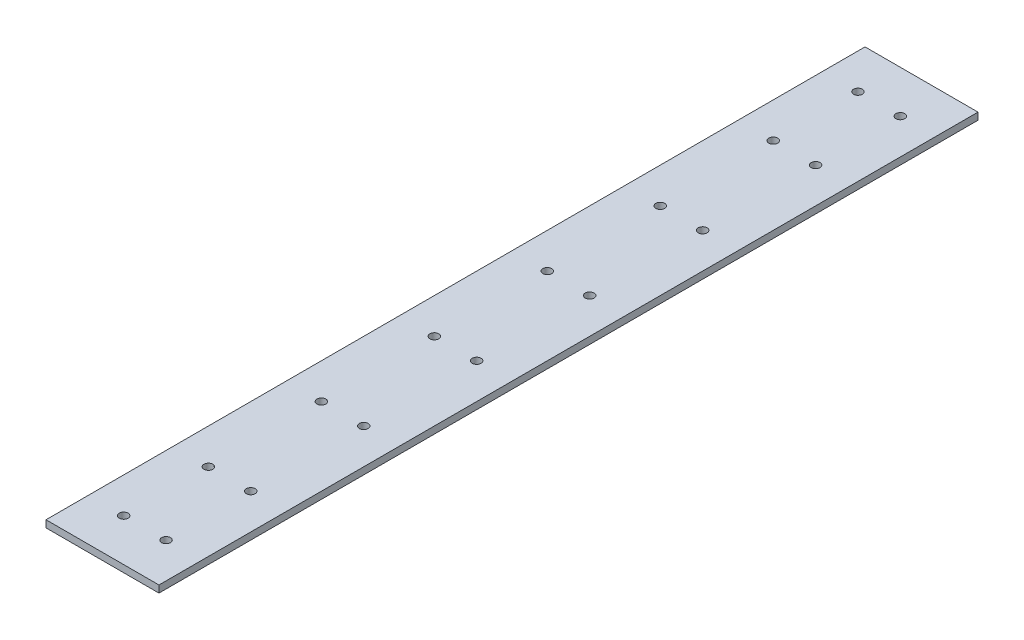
ISO-10303-21;
HEADER;
FILE_DESCRIPTION(('STEP AP214'),'2;1');
FILE_NAME('part.step','',(''),(''),'','','');
FILE_SCHEMA(('AUTOMOTIVE_DESIGN { 1 0 10303 214 1 1 1 1 }'));
ENDSEC;
DATA;
#1=APPLICATION_CONTEXT('core data for automotive mechanical design processes');
#2=APPLICATION_PROTOCOL_DEFINITION('international standard','automotive_design',2000,#1);
#3=PRODUCT_CONTEXT('',#1,'mechanical');
#4=PRODUCT('Part','Part','',(#3));
#5=PRODUCT_RELATED_PRODUCT_CATEGORY('part','',(#4));
#6=PRODUCT_DEFINITION_FORMATION('','',#4);
#7=PRODUCT_DEFINITION_CONTEXT('part definition',#1,'design');
#8=PRODUCT_DEFINITION('design','',#6,#7);
#9=PRODUCT_DEFINITION_SHAPE('','',#8);
#10=(LENGTH_UNIT() NAMED_UNIT(*) SI_UNIT(.MILLI.,.METRE.));
#11=(NAMED_UNIT(*) PLANE_ANGLE_UNIT() SI_UNIT($,.RADIAN.));
#12=(NAMED_UNIT(*) SI_UNIT($,.STERADIAN.) SOLID_ANGLE_UNIT());
#13=UNCERTAINTY_MEASURE_WITH_UNIT(LENGTH_MEASURE(1.E-05),#10,'distance_accuracy_value','');
#14=(GEOMETRIC_REPRESENTATION_CONTEXT(3) GLOBAL_UNCERTAINTY_ASSIGNED_CONTEXT((#13)) GLOBAL_UNIT_ASSIGNED_CONTEXT((#10,
#11,#12)) REPRESENTATION_CONTEXT('',''));
#15=CARTESIAN_POINT('',(0.,0.,0.));
#16=DIRECTION('',(0.,0.,1.));
#17=DIRECTION('',(1.,0.,0.));
#18=AXIS2_PLACEMENT_3D('',#15,#16,#17);
#19=CARTESIAN_POINT('',(-50.8,-3.17500000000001,736.6));
#20=DIRECTION('',(1.,0.,0.));
#21=DIRECTION('',(0.,0.,-1.));
#22=AXIS2_PLACEMENT_3D('',#19,#20,#21);
#23=PLANE('',#22);
#24=DIRECTION('',(0.,-1.,0.));
#25=VECTOR('',#24,1.);
#26=CARTESIAN_POINT('',(-50.8,-3.17500000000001,0.));
#27=LINE('',#26,#25);
#28=CARTESIAN_POINT('',(-50.8,3.17499999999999,0.));
#29=VERTEX_POINT('',#28);
#30=CARTESIAN_POINT('',(-50.8,-3.17500000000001,0.));
#31=VERTEX_POINT('',#30);
#32=EDGE_CURVE('E95',#29,#31,#27,.T.);
#33=ORIENTED_EDGE('',*,*,#32,.T.);
#34=DIRECTION('',(0.,0.,-1.));
#35=VECTOR('',#34,1.);
#36=CARTESIAN_POINT('',(-50.8,-3.17500000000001,736.6));
#37=LINE('',#36,#35);
#38=CARTESIAN_POINT('',(-50.8,-3.17500000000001,736.6));
#39=VERTEX_POINT('',#38);
#40=EDGE_CURVE('E11',#39,#31,#37,.T.);
#41=ORIENTED_EDGE('',*,*,#40,.F.);
#42=DIRECTION('',(0.,-1.,0.));
#43=VECTOR('',#42,1.);
#44=CARTESIAN_POINT('',(-50.8,-3.17500000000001,736.6));
#45=LINE('',#44,#43);
#46=CARTESIAN_POINT('',(-50.8,3.17499999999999,736.6));
#47=VERTEX_POINT('',#46);
#48=EDGE_CURVE('E83',#47,#39,#45,.T.);
#49=ORIENTED_EDGE('',*,*,#48,.F.);
#50=DIRECTION('',(0.,0.,-1.));
#51=VECTOR('',#50,1.);
#52=CARTESIAN_POINT('',(-50.8,3.17499999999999,736.6));
#53=LINE('',#52,#51);
#54=EDGE_CURVE('E91',#47,#29,#53,.T.);
#55=ORIENTED_EDGE('',*,*,#54,.T.);
#56=EDGE_LOOP('',(#33,#41,#49,#55));
#57=FACE_BOUND('',#56,.T.);
#58=ADVANCED_FACE('F32',(#57),#23,.F.);
#59=CARTESIAN_POINT('',(50.8,-3.17499999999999,736.6));
#60=DIRECTION('',(0.,1.,0.));
#61=DIRECTION('',(-1.,0.,0.));
#62=AXIS2_PLACEMENT_3D('',#59,#60,#61);
#63=PLANE('',#62);
#64=CARTESIAN_POINT('',(-19.05,-3.175,114.3));
#65=DIRECTION('',(0.,1.,0.));
#66=DIRECTION('',(-1.,0.,0.));
#67=AXIS2_PLACEMENT_3D('',#64,#65,#66);
#68=CIRCLE('',#67,3.9751);
#69=CARTESIAN_POINT('',(-23.0251,-3.175,114.3));
#70=VERTEX_POINT('',#69);
#71=EDGE_CURVE('E196',#70,#70,#68,.T.);
#72=ORIENTED_EDGE('',*,*,#71,.T.);
#73=EDGE_LOOP('',(#72));
#74=FACE_BOUND('',#73,.T.);
#75=CARTESIAN_POINT('',(-19.05,-3.175,215.9));
#76=DIRECTION('',(0.,1.,0.));
#77=DIRECTION('',(-1.,0.,0.));
#78=AXIS2_PLACEMENT_3D('',#75,#76,#77);
#79=CIRCLE('',#78,3.97510000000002);
#80=CARTESIAN_POINT('',(-23.0251,-3.175,215.9));
#81=VERTEX_POINT('',#80);
#82=EDGE_CURVE('E190',#81,#81,#79,.T.);
#83=ORIENTED_EDGE('',*,*,#82,.T.);
#84=EDGE_LOOP('',(#83));
#85=FACE_BOUND('',#84,.T.);
#86=CARTESIAN_POINT('',(-19.05,-3.175,317.5));
#87=DIRECTION('',(0.,1.,0.));
#88=DIRECTION('',(-1.,0.,0.));
#89=AXIS2_PLACEMENT_3D('',#86,#87,#88);
#90=CIRCLE('',#89,3.97510000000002);
#91=CARTESIAN_POINT('',(-23.0251,-3.175,317.5));
#92=VERTEX_POINT('',#91);
#93=EDGE_CURVE('E184',#92,#92,#90,.T.);
#94=ORIENTED_EDGE('',*,*,#93,.T.);
#95=EDGE_LOOP('',(#94));
#96=FACE_BOUND('',#95,.T.);
#97=CARTESIAN_POINT('',(-19.05,-3.175,419.1));
#98=DIRECTION('',(0.,1.,0.));
#99=DIRECTION('',(-1.,0.,0.));
#100=AXIS2_PLACEMENT_3D('',#97,#98,#99);
#101=CIRCLE('',#100,3.97510000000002);
#102=CARTESIAN_POINT('',(-23.0251,-3.175,419.1));
#103=VERTEX_POINT('',#102);
#104=EDGE_CURVE('E178',#103,#103,#101,.T.);
#105=ORIENTED_EDGE('',*,*,#104,.T.);
#106=EDGE_LOOP('',(#105));
#107=FACE_BOUND('',#106,.T.);
#108=CARTESIAN_POINT('',(-19.05,-3.175,520.7));
#109=DIRECTION('',(0.,1.,0.));
#110=DIRECTION('',(-1.,0.,0.));
#111=AXIS2_PLACEMENT_3D('',#108,#109,#110);
#112=CIRCLE('',#111,3.97510000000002);
#113=CARTESIAN_POINT('',(-23.0251,-3.175,520.7));
#114=VERTEX_POINT('',#113);
#115=EDGE_CURVE('E172',#114,#114,#112,.T.);
#116=ORIENTED_EDGE('',*,*,#115,.T.);
#117=EDGE_LOOP('',(#116));
#118=FACE_BOUND('',#117,.T.);
#119=CARTESIAN_POINT('',(-19.05,-3.175,622.3));
#120=DIRECTION('',(0.,1.,0.));
#121=DIRECTION('',(-1.,0.,0.));
#122=AXIS2_PLACEMENT_3D('',#119,#120,#121);
#123=CIRCLE('',#122,3.97510000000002);
#124=CARTESIAN_POINT('',(-23.0251,-3.175,622.3));
#125=VERTEX_POINT('',#124);
#126=EDGE_CURVE('E166',#125,#125,#123,.T.);
#127=ORIENTED_EDGE('',*,*,#126,.T.);
#128=EDGE_LOOP('',(#127));
#129=FACE_BOUND('',#128,.T.);
#130=CARTESIAN_POINT('',(-19.05,-3.175,698.5));
#131=DIRECTION('',(0.,1.,0.));
#132=DIRECTION('',(-1.,0.,0.));
#133=AXIS2_PLACEMENT_3D('',#130,#131,#132);
#134=CIRCLE('',#133,3.97510000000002);
#135=CARTESIAN_POINT('',(-23.0251,-3.175,698.5));
#136=VERTEX_POINT('',#135);
#137=EDGE_CURVE('E160',#136,#136,#134,.T.);
#138=ORIENTED_EDGE('',*,*,#137,.T.);
#139=EDGE_LOOP('',(#138));
#140=FACE_BOUND('',#139,.T.);
#141=CARTESIAN_POINT('',(19.05,-3.175,698.5));
#142=DIRECTION('',(0.,1.,0.));
#143=DIRECTION('',(-1.,0.,0.));
#144=AXIS2_PLACEMENT_3D('',#141,#142,#143);
#145=CIRCLE('',#144,3.97510000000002);
#146=CARTESIAN_POINT('',(15.0749,-3.175,698.5));
#147=VERTEX_POINT('',#146);
#148=EDGE_CURVE('E154',#147,#147,#145,.T.);
#149=ORIENTED_EDGE('',*,*,#148,.T.);
#150=EDGE_LOOP('',(#149));
#151=FACE_BOUND('',#150,.T.);
#152=CARTESIAN_POINT('',(19.05,-3.175,622.3));
#153=DIRECTION('',(0.,1.,0.));
#154=DIRECTION('',(-1.,0.,0.));
#155=AXIS2_PLACEMENT_3D('',#152,#153,#154);
#156=CIRCLE('',#155,3.97510000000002);
#157=CARTESIAN_POINT('',(15.0749,-3.175,622.3));
#158=VERTEX_POINT('',#157);
#159=EDGE_CURVE('E148',#158,#158,#156,.T.);
#160=ORIENTED_EDGE('',*,*,#159,.T.);
#161=EDGE_LOOP('',(#160));
#162=FACE_BOUND('',#161,.T.);
#163=CARTESIAN_POINT('',(19.05,-3.175,520.7));
#164=DIRECTION('',(0.,1.,0.));
#165=DIRECTION('',(-1.,0.,0.));
#166=AXIS2_PLACEMENT_3D('',#163,#164,#165);
#167=CIRCLE('',#166,3.97510000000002);
#168=CARTESIAN_POINT('',(15.0749,-3.175,520.7));
#169=VERTEX_POINT('',#168);
#170=EDGE_CURVE('E142',#169,#169,#167,.T.);
#171=ORIENTED_EDGE('',*,*,#170,.T.);
#172=EDGE_LOOP('',(#171));
#173=FACE_BOUND('',#172,.T.);
#174=CARTESIAN_POINT('',(19.05,-3.175,419.1));
#175=DIRECTION('',(0.,1.,0.));
#176=DIRECTION('',(-1.,0.,0.));
#177=AXIS2_PLACEMENT_3D('',#174,#175,#176);
#178=CIRCLE('',#177,3.97510000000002);
#179=CARTESIAN_POINT('',(15.0749,-3.175,419.1));
#180=VERTEX_POINT('',#179);
#181=EDGE_CURVE('E136',#180,#180,#178,.T.);
#182=ORIENTED_EDGE('',*,*,#181,.T.);
#183=EDGE_LOOP('',(#182));
#184=FACE_BOUND('',#183,.T.);
#185=CARTESIAN_POINT('',(19.05,-3.175,317.5));
#186=DIRECTION('',(0.,1.,0.));
#187=DIRECTION('',(-1.,0.,0.));
#188=AXIS2_PLACEMENT_3D('',#185,#186,#187);
#189=CIRCLE('',#188,3.97510000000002);
#190=CARTESIAN_POINT('',(15.0749,-3.175,317.5));
#191=VERTEX_POINT('',#190);
#192=EDGE_CURVE('E130',#191,#191,#189,.T.);
#193=ORIENTED_EDGE('',*,*,#192,.T.);
#194=EDGE_LOOP('',(#193));
#195=FACE_BOUND('',#194,.T.);
#196=CARTESIAN_POINT('',(19.05,-3.175,215.9));
#197=DIRECTION('',(0.,1.,0.));
#198=DIRECTION('',(-1.,0.,0.));
#199=AXIS2_PLACEMENT_3D('',#196,#197,#198);
#200=CIRCLE('',#199,3.97510000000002);
#201=CARTESIAN_POINT('',(15.0749,-3.175,215.9));
#202=VERTEX_POINT('',#201);
#203=EDGE_CURVE('E124',#202,#202,#200,.T.);
#204=ORIENTED_EDGE('',*,*,#203,.T.);
#205=EDGE_LOOP('',(#204));
#206=FACE_BOUND('',#205,.T.);
#207=CARTESIAN_POINT('',(19.05,-3.175,114.3));
#208=DIRECTION('',(0.,1.,0.));
#209=DIRECTION('',(-1.,0.,0.));
#210=AXIS2_PLACEMENT_3D('',#207,#208,#209);
#211=CIRCLE('',#210,3.9751);
#212=CARTESIAN_POINT('',(15.0749,-3.175,114.3));
#213=VERTEX_POINT('',#212);
#214=EDGE_CURVE('E118',#213,#213,#211,.T.);
#215=ORIENTED_EDGE('',*,*,#214,.T.);
#216=EDGE_LOOP('',(#215));
#217=FACE_BOUND('',#216,.T.);
#218=CARTESIAN_POINT('',(19.05,-3.175,38.1));
#219=DIRECTION('',(0.,1.,0.));
#220=DIRECTION('',(-1.,0.,0.));
#221=AXIS2_PLACEMENT_3D('',#218,#219,#220);
#222=CIRCLE('',#221,3.97509999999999);
#223=CARTESIAN_POINT('',(15.0749,-3.175,38.1));
#224=VERTEX_POINT('',#223);
#225=EDGE_CURVE('E112',#224,#224,#222,.T.);
#226=ORIENTED_EDGE('',*,*,#225,.T.);
#227=EDGE_LOOP('',(#226));
#228=FACE_BOUND('',#227,.T.);
#229=CARTESIAN_POINT('',(-19.05,-3.175,38.1));
#230=DIRECTION('',(0.,1.,0.));
#231=DIRECTION('',(-1.,0.,0.));
#232=AXIS2_PLACEMENT_3D('',#229,#230,#231);
#233=CIRCLE('',#232,3.9751);
#234=CARTESIAN_POINT('',(-23.0251,-3.175,38.1));
#235=VERTEX_POINT('',#234);
#236=EDGE_CURVE('E98',#235,#235,#233,.T.);
#237=ORIENTED_EDGE('',*,*,#236,.T.);
#238=EDGE_LOOP('',(#237));
#239=FACE_BOUND('',#238,.T.);
#240=DIRECTION('',(1.,0.,0.));
#241=VECTOR('',#240,1.);
#242=CARTESIAN_POINT('',(50.8,-3.17499999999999,0.));
#243=LINE('',#242,#241);
#244=CARTESIAN_POINT('',(50.8,-3.17499999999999,0.));
#245=VERTEX_POINT('',#244);
#246=EDGE_CURVE('E87',#31,#245,#243,.T.);
#247=ORIENTED_EDGE('',*,*,#246,.T.);
#248=DIRECTION('',(0.,0.,-1.));
#249=VECTOR('',#248,1.);
#250=CARTESIAN_POINT('',(50.8,-3.17499999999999,736.6));
#251=LINE('',#250,#249);
#252=CARTESIAN_POINT('',(50.8,-3.17499999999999,736.6));
#253=VERTEX_POINT('',#252);
#254=EDGE_CURVE('E40',#253,#245,#251,.T.);
#255=ORIENTED_EDGE('',*,*,#254,.F.);
#256=DIRECTION('',(1.,0.,0.));
#257=VECTOR('',#256,1.);
#258=CARTESIAN_POINT('',(50.8,-3.17499999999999,736.6));
#259=LINE('',#258,#257);
#260=EDGE_CURVE('E78',#39,#253,#259,.T.);
#261=ORIENTED_EDGE('',*,*,#260,.F.);
#262=ORIENTED_EDGE('',*,*,#40,.T.);
#263=EDGE_LOOP('',(#247,#255,#261,#262));
#264=FACE_BOUND('',#263,.T.);
#265=ADVANCED_FACE('F86',(#74,#85,#96,#107,#118,#129,#140,#151,#162,#173,#184,#195,#206,#217,
#228,#239,#264),#63,.F.);
#266=CARTESIAN_POINT('',(50.8,-3.17499999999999,736.6));
#267=DIRECTION('',(-1.,0.,0.));
#268=DIRECTION('',(0.,0.,1.));
#269=AXIS2_PLACEMENT_3D('',#266,#267,#268);
#270=PLANE('',#269);
#271=DIRECTION('',(0.,1.,0.));
#272=VECTOR('',#271,1.);
#273=CARTESIAN_POINT('',(50.8,-3.17499999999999,0.));
#274=LINE('',#273,#272);
#275=CARTESIAN_POINT('',(50.8,3.17500000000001,0.));
#276=VERTEX_POINT('',#275);
#277=EDGE_CURVE('E65',#245,#276,#274,.T.);
#278=ORIENTED_EDGE('',*,*,#277,.T.);
#279=DIRECTION('',(0.,0.,-1.));
#280=VECTOR('',#279,1.);
#281=CARTESIAN_POINT('',(50.8,3.17500000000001,736.6));
#282=LINE('',#281,#280);
#283=CARTESIAN_POINT('',(50.8,3.17500000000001,736.6));
#284=VERTEX_POINT('',#283);
#285=EDGE_CURVE('E88',#284,#276,#282,.T.);
#286=ORIENTED_EDGE('',*,*,#285,.F.);
#287=DIRECTION('',(0.,1.,0.));
#288=VECTOR('',#287,1.);
#289=CARTESIAN_POINT('',(50.8,-3.17499999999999,736.6));
#290=LINE('',#289,#288);
#291=EDGE_CURVE('E81',#253,#284,#290,.T.);
#292=ORIENTED_EDGE('',*,*,#291,.F.);
#293=ORIENTED_EDGE('',*,*,#254,.T.);
#294=EDGE_LOOP('',(#278,#286,#292,#293));
#295=FACE_BOUND('',#294,.T.);
#296=ADVANCED_FACE('F89',(#295),#270,.F.);
#297=CARTESIAN_POINT('',(50.8,3.17500000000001,736.6));
#298=DIRECTION('',(0.,-1.,0.));
#299=DIRECTION('',(1.,0.,0.));
#300=AXIS2_PLACEMENT_3D('',#297,#298,#299);
#301=PLANE('',#300);
#302=CARTESIAN_POINT('',(-19.05,3.175,114.3));
#303=DIRECTION('',(0.,1.,0.));
#304=DIRECTION('',(-1.,0.,0.));
#305=AXIS2_PLACEMENT_3D('',#302,#303,#304);
#306=CIRCLE('',#305,3.9751);
#307=CARTESIAN_POINT('',(-23.0251,3.175,114.3));
#308=VERTEX_POINT('',#307);
#309=EDGE_CURVE('E199',#308,#308,#306,.T.);
#310=ORIENTED_EDGE('',*,*,#309,.F.);
#311=EDGE_LOOP('',(#310));
#312=FACE_BOUND('',#311,.T.);
#313=CARTESIAN_POINT('',(-19.05,3.175,215.9));
#314=DIRECTION('',(0.,1.,0.));
#315=DIRECTION('',(-1.,0.,0.));
#316=AXIS2_PLACEMENT_3D('',#313,#314,#315);
#317=CIRCLE('',#316,3.97510000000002);
#318=CARTESIAN_POINT('',(-23.0251,3.175,215.9));
#319=VERTEX_POINT('',#318);
#320=EDGE_CURVE('E193',#319,#319,#317,.T.);
#321=ORIENTED_EDGE('',*,*,#320,.F.);
#322=EDGE_LOOP('',(#321));
#323=FACE_BOUND('',#322,.T.);
#324=CARTESIAN_POINT('',(-19.05,3.175,317.5));
#325=DIRECTION('',(0.,1.,0.));
#326=DIRECTION('',(-1.,0.,0.));
#327=AXIS2_PLACEMENT_3D('',#324,#325,#326);
#328=CIRCLE('',#327,3.97510000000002);
#329=CARTESIAN_POINT('',(-23.0251,3.175,317.5));
#330=VERTEX_POINT('',#329);
#331=EDGE_CURVE('E187',#330,#330,#328,.T.);
#332=ORIENTED_EDGE('',*,*,#331,.F.);
#333=EDGE_LOOP('',(#332));
#334=FACE_BOUND('',#333,.T.);
#335=CARTESIAN_POINT('',(-19.05,3.175,419.1));
#336=DIRECTION('',(0.,1.,0.));
#337=DIRECTION('',(-1.,0.,0.));
#338=AXIS2_PLACEMENT_3D('',#335,#336,#337);
#339=CIRCLE('',#338,3.97510000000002);
#340=CARTESIAN_POINT('',(-23.0251,3.175,419.1));
#341=VERTEX_POINT('',#340);
#342=EDGE_CURVE('E181',#341,#341,#339,.T.);
#343=ORIENTED_EDGE('',*,*,#342,.F.);
#344=EDGE_LOOP('',(#343));
#345=FACE_BOUND('',#344,.T.);
#346=CARTESIAN_POINT('',(-19.05,3.175,520.7));
#347=DIRECTION('',(0.,1.,0.));
#348=DIRECTION('',(-1.,0.,0.));
#349=AXIS2_PLACEMENT_3D('',#346,#347,#348);
#350=CIRCLE('',#349,3.97510000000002);
#351=CARTESIAN_POINT('',(-23.0251,3.175,520.7));
#352=VERTEX_POINT('',#351);
#353=EDGE_CURVE('E175',#352,#352,#350,.T.);
#354=ORIENTED_EDGE('',*,*,#353,.F.);
#355=EDGE_LOOP('',(#354));
#356=FACE_BOUND('',#355,.T.);
#357=CARTESIAN_POINT('',(-19.05,3.175,622.3));
#358=DIRECTION('',(0.,1.,0.));
#359=DIRECTION('',(-1.,0.,0.));
#360=AXIS2_PLACEMENT_3D('',#357,#358,#359);
#361=CIRCLE('',#360,3.97510000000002);
#362=CARTESIAN_POINT('',(-23.0251,3.175,622.3));
#363=VERTEX_POINT('',#362);
#364=EDGE_CURVE('E169',#363,#363,#361,.T.);
#365=ORIENTED_EDGE('',*,*,#364,.F.);
#366=EDGE_LOOP('',(#365));
#367=FACE_BOUND('',#366,.T.);
#368=CARTESIAN_POINT('',(-19.05,3.175,698.5));
#369=DIRECTION('',(0.,1.,0.));
#370=DIRECTION('',(-1.,0.,0.));
#371=AXIS2_PLACEMENT_3D('',#368,#369,#370);
#372=CIRCLE('',#371,3.97510000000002);
#373=CARTESIAN_POINT('',(-23.0251,3.175,698.5));
#374=VERTEX_POINT('',#373);
#375=EDGE_CURVE('E163',#374,#374,#372,.T.);
#376=ORIENTED_EDGE('',*,*,#375,.F.);
#377=EDGE_LOOP('',(#376));
#378=FACE_BOUND('',#377,.T.);
#379=CARTESIAN_POINT('',(19.05,3.175,698.5));
#380=DIRECTION('',(0.,1.,0.));
#381=DIRECTION('',(-1.,0.,0.));
#382=AXIS2_PLACEMENT_3D('',#379,#380,#381);
#383=CIRCLE('',#382,3.97510000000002);
#384=CARTESIAN_POINT('',(15.0749,3.175,698.5));
#385=VERTEX_POINT('',#384);
#386=EDGE_CURVE('E157',#385,#385,#383,.T.);
#387=ORIENTED_EDGE('',*,*,#386,.F.);
#388=EDGE_LOOP('',(#387));
#389=FACE_BOUND('',#388,.T.);
#390=CARTESIAN_POINT('',(19.05,3.175,622.3));
#391=DIRECTION('',(0.,1.,0.));
#392=DIRECTION('',(-1.,0.,0.));
#393=AXIS2_PLACEMENT_3D('',#390,#391,#392);
#394=CIRCLE('',#393,3.97510000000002);
#395=CARTESIAN_POINT('',(15.0749,3.175,622.3));
#396=VERTEX_POINT('',#395);
#397=EDGE_CURVE('E151',#396,#396,#394,.T.);
#398=ORIENTED_EDGE('',*,*,#397,.F.);
#399=EDGE_LOOP('',(#398));
#400=FACE_BOUND('',#399,.T.);
#401=CARTESIAN_POINT('',(19.05,3.175,520.7));
#402=DIRECTION('',(0.,1.,0.));
#403=DIRECTION('',(-1.,0.,0.));
#404=AXIS2_PLACEMENT_3D('',#401,#402,#403);
#405=CIRCLE('',#404,3.97510000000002);
#406=CARTESIAN_POINT('',(15.0749,3.175,520.7));
#407=VERTEX_POINT('',#406);
#408=EDGE_CURVE('E145',#407,#407,#405,.T.);
#409=ORIENTED_EDGE('',*,*,#408,.F.);
#410=EDGE_LOOP('',(#409));
#411=FACE_BOUND('',#410,.T.);
#412=CARTESIAN_POINT('',(19.05,3.175,419.1));
#413=DIRECTION('',(0.,1.,0.));
#414=DIRECTION('',(-1.,0.,0.));
#415=AXIS2_PLACEMENT_3D('',#412,#413,#414);
#416=CIRCLE('',#415,3.97510000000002);
#417=CARTESIAN_POINT('',(15.0749,3.175,419.1));
#418=VERTEX_POINT('',#417);
#419=EDGE_CURVE('E139',#418,#418,#416,.T.);
#420=ORIENTED_EDGE('',*,*,#419,.F.);
#421=EDGE_LOOP('',(#420));
#422=FACE_BOUND('',#421,.T.);
#423=CARTESIAN_POINT('',(19.05,3.175,317.5));
#424=DIRECTION('',(0.,1.,0.));
#425=DIRECTION('',(-1.,0.,0.));
#426=AXIS2_PLACEMENT_3D('',#423,#424,#425);
#427=CIRCLE('',#426,3.97510000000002);
#428=CARTESIAN_POINT('',(15.0749,3.175,317.5));
#429=VERTEX_POINT('',#428);
#430=EDGE_CURVE('E133',#429,#429,#427,.T.);
#431=ORIENTED_EDGE('',*,*,#430,.F.);
#432=EDGE_LOOP('',(#431));
#433=FACE_BOUND('',#432,.T.);
#434=CARTESIAN_POINT('',(19.05,3.175,215.9));
#435=DIRECTION('',(0.,1.,0.));
#436=DIRECTION('',(-1.,0.,0.));
#437=AXIS2_PLACEMENT_3D('',#434,#435,#436);
#438=CIRCLE('',#437,3.97510000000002);
#439=CARTESIAN_POINT('',(15.0749,3.175,215.9));
#440=VERTEX_POINT('',#439);
#441=EDGE_CURVE('E127',#440,#440,#438,.T.);
#442=ORIENTED_EDGE('',*,*,#441,.F.);
#443=EDGE_LOOP('',(#442));
#444=FACE_BOUND('',#443,.T.);
#445=CARTESIAN_POINT('',(19.05,3.175,114.3));
#446=DIRECTION('',(0.,1.,0.));
#447=DIRECTION('',(-1.,0.,0.));
#448=AXIS2_PLACEMENT_3D('',#445,#446,#447);
#449=CIRCLE('',#448,3.9751);
#450=CARTESIAN_POINT('',(15.0749,3.175,114.3));
#451=VERTEX_POINT('',#450);
#452=EDGE_CURVE('E121',#451,#451,#449,.T.);
#453=ORIENTED_EDGE('',*,*,#452,.F.);
#454=EDGE_LOOP('',(#453));
#455=FACE_BOUND('',#454,.T.);
#456=CARTESIAN_POINT('',(19.05,3.175,38.1));
#457=DIRECTION('',(0.,1.,0.));
#458=DIRECTION('',(-1.,0.,0.));
#459=AXIS2_PLACEMENT_3D('',#456,#457,#458);
#460=CIRCLE('',#459,3.97509999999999);
#461=CARTESIAN_POINT('',(15.0749,3.175,38.1));
#462=VERTEX_POINT('',#461);
#463=EDGE_CURVE('E115',#462,#462,#460,.T.);
#464=ORIENTED_EDGE('',*,*,#463,.F.);
#465=EDGE_LOOP('',(#464));
#466=FACE_BOUND('',#465,.T.);
#467=CARTESIAN_POINT('',(-19.05,3.175,38.1));
#468=DIRECTION('',(0.,1.,0.));
#469=DIRECTION('',(-1.,0.,0.));
#470=AXIS2_PLACEMENT_3D('',#467,#468,#469);
#471=CIRCLE('',#470,3.9751);
#472=CARTESIAN_POINT('',(-23.0251,3.175,38.1));
#473=VERTEX_POINT('',#472);
#474=EDGE_CURVE('E109',#473,#473,#471,.T.);
#475=ORIENTED_EDGE('',*,*,#474,.F.);
#476=EDGE_LOOP('',(#475));
#477=FACE_BOUND('',#476,.T.);
#478=DIRECTION('',(-1.,0.,0.));
#479=VECTOR('',#478,1.);
#480=CARTESIAN_POINT('',(50.8,3.17500000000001,0.));
#481=LINE('',#480,#479);
#482=EDGE_CURVE('E71',#276,#29,#481,.T.);
#483=ORIENTED_EDGE('',*,*,#482,.T.);
#484=ORIENTED_EDGE('',*,*,#54,.F.);
#485=DIRECTION('',(-1.,0.,0.));
#486=VECTOR('',#485,1.);
#487=CARTESIAN_POINT('',(50.8,3.17500000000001,736.6));
#488=LINE('',#487,#486);
#489=EDGE_CURVE('E48',#284,#47,#488,.T.);
#490=ORIENTED_EDGE('',*,*,#489,.F.);
#491=ORIENTED_EDGE('',*,*,#285,.T.);
#492=EDGE_LOOP('',(#483,#484,#490,#491));
#493=FACE_BOUND('',#492,.T.);
#494=ADVANCED_FACE('F103',(#312,#323,#334,#345,#356,#367,#378,#389,#400,#411,#422,#433,#444,
#455,#466,#477,#493),#301,.F.);
#495=CARTESIAN_POINT('',(-50.8,3.17499999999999,736.6));
#496=DIRECTION('',(0.,0.,1.));
#497=DIRECTION('',(1.,0.,0.));
#498=AXIS2_PLACEMENT_3D('',#495,#496,#497);
#499=PLANE('',#498);
#500=ORIENTED_EDGE('',*,*,#48,.T.);
#501=ORIENTED_EDGE('',*,*,#260,.T.);
#502=ORIENTED_EDGE('',*,*,#291,.T.);
#503=ORIENTED_EDGE('',*,*,#489,.T.);
#504=EDGE_LOOP('',(#500,#501,#502,#503));
#505=FACE_BOUND('',#504,.T.);
#506=ADVANCED_FACE('F79',(#505),#499,.T.);
#507=CARTESIAN_POINT('',(-50.8,3.17499999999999,0.));
#508=DIRECTION('',(0.,0.,1.));
#509=DIRECTION('',(1.,0.,0.));
#510=AXIS2_PLACEMENT_3D('',#507,#508,#509);
#511=PLANE('',#510);
#512=ORIENTED_EDGE('',*,*,#32,.F.);
#513=ORIENTED_EDGE('',*,*,#482,.F.);
#514=ORIENTED_EDGE('',*,*,#277,.F.);
#515=ORIENTED_EDGE('',*,*,#246,.F.);
#516=EDGE_LOOP('',(#512,#513,#514,#515));
#517=FACE_BOUND('',#516,.T.);
#518=ADVANCED_FACE('F106',(#517),#511,.F.);
#519=CARTESIAN_POINT('',(-19.05,-3.175,38.1));
#520=DIRECTION('',(0.,1.,0.));
#521=DIRECTION('',(-1.,0.,0.));
#522=AXIS2_PLACEMENT_3D('',#519,#520,#521);
#523=CYLINDRICAL_SURFACE('',#522,3.9751);
#524=ORIENTED_EDGE('',*,*,#236,.F.);
#525=EDGE_LOOP('',(#524));
#526=FACE_BOUND('',#525,.T.);
#527=ORIENTED_EDGE('',*,*,#474,.T.);
#528=EDGE_LOOP('',(#527));
#529=FACE_BOUND('',#528,.T.);
#530=ADVANCED_FACE('F247',(#526,#529),#523,.F.);
#531=CARTESIAN_POINT('',(19.05,-3.175,38.1));
#532=DIRECTION('',(0.,1.,0.));
#533=DIRECTION('',(-1.,0.,0.));
#534=AXIS2_PLACEMENT_3D('',#531,#532,#533);
#535=CYLINDRICAL_SURFACE('',#534,3.97509999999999);
#536=ORIENTED_EDGE('',*,*,#225,.F.);
#537=EDGE_LOOP('',(#536));
#538=FACE_BOUND('',#537,.T.);
#539=ORIENTED_EDGE('',*,*,#463,.T.);
#540=EDGE_LOOP('',(#539));
#541=FACE_BOUND('',#540,.T.);
#542=ADVANCED_FACE('F249',(#538,#541),#535,.F.);
#543=CARTESIAN_POINT('',(19.05,-3.175,114.3));
#544=DIRECTION('',(0.,1.,0.));
#545=DIRECTION('',(-1.,0.,0.));
#546=AXIS2_PLACEMENT_3D('',#543,#544,#545);
#547=CYLINDRICAL_SURFACE('',#546,3.9751);
#548=ORIENTED_EDGE('',*,*,#214,.F.);
#549=EDGE_LOOP('',(#548));
#550=FACE_BOUND('',#549,.T.);
#551=ORIENTED_EDGE('',*,*,#452,.T.);
#552=EDGE_LOOP('',(#551));
#553=FACE_BOUND('',#552,.T.);
#554=ADVANCED_FACE('F256',(#550,#553),#547,.F.);
#555=CARTESIAN_POINT('',(19.05,-3.175,215.9));
#556=DIRECTION('',(0.,1.,0.));
#557=DIRECTION('',(-1.,0.,0.));
#558=AXIS2_PLACEMENT_3D('',#555,#556,#557);
#559=CYLINDRICAL_SURFACE('',#558,3.97510000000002);
#560=ORIENTED_EDGE('',*,*,#203,.F.);
#561=EDGE_LOOP('',(#560));
#562=FACE_BOUND('',#561,.T.);
#563=ORIENTED_EDGE('',*,*,#441,.T.);
#564=EDGE_LOOP('',(#563));
#565=FACE_BOUND('',#564,.T.);
#566=ADVANCED_FACE('F309',(#562,#565),#559,.F.);
#567=CARTESIAN_POINT('',(19.05,-3.175,317.5));
#568=DIRECTION('',(0.,1.,0.));
#569=DIRECTION('',(-1.,0.,0.));
#570=AXIS2_PLACEMENT_3D('',#567,#568,#569);
#571=CYLINDRICAL_SURFACE('',#570,3.97510000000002);
#572=ORIENTED_EDGE('',*,*,#192,.F.);
#573=EDGE_LOOP('',(#572));
#574=FACE_BOUND('',#573,.T.);
#575=ORIENTED_EDGE('',*,*,#430,.T.);
#576=EDGE_LOOP('',(#575));
#577=FACE_BOUND('',#576,.T.);
#578=ADVANCED_FACE('F319',(#574,#577),#571,.F.);
#579=CARTESIAN_POINT('',(19.05,-3.175,419.1));
#580=DIRECTION('',(0.,1.,0.));
#581=DIRECTION('',(-1.,0.,0.));
#582=AXIS2_PLACEMENT_3D('',#579,#580,#581);
#583=CYLINDRICAL_SURFACE('',#582,3.97510000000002);
#584=ORIENTED_EDGE('',*,*,#181,.F.);
#585=EDGE_LOOP('',(#584));
#586=FACE_BOUND('',#585,.T.);
#587=ORIENTED_EDGE('',*,*,#419,.T.);
#588=EDGE_LOOP('',(#587));
#589=FACE_BOUND('',#588,.T.);
#590=ADVANCED_FACE('F329',(#586,#589),#583,.F.);
#591=CARTESIAN_POINT('',(19.05,-3.175,520.7));
#592=DIRECTION('',(0.,1.,0.));
#593=DIRECTION('',(-1.,0.,0.));
#594=AXIS2_PLACEMENT_3D('',#591,#592,#593);
#595=CYLINDRICAL_SURFACE('',#594,3.97510000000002);
#596=ORIENTED_EDGE('',*,*,#170,.F.);
#597=EDGE_LOOP('',(#596));
#598=FACE_BOUND('',#597,.T.);
#599=ORIENTED_EDGE('',*,*,#408,.T.);
#600=EDGE_LOOP('',(#599));
#601=FACE_BOUND('',#600,.T.);
#602=ADVANCED_FACE('F339',(#598,#601),#595,.F.);
#603=CARTESIAN_POINT('',(19.05,-3.175,622.3));
#604=DIRECTION('',(0.,1.,0.));
#605=DIRECTION('',(-1.,0.,0.));
#606=AXIS2_PLACEMENT_3D('',#603,#604,#605);
#607=CYLINDRICAL_SURFACE('',#606,3.97510000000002);
#608=ORIENTED_EDGE('',*,*,#159,.F.);
#609=EDGE_LOOP('',(#608));
#610=FACE_BOUND('',#609,.T.);
#611=ORIENTED_EDGE('',*,*,#397,.T.);
#612=EDGE_LOOP('',(#611));
#613=FACE_BOUND('',#612,.T.);
#614=ADVANCED_FACE('F349',(#610,#613),#607,.F.);
#615=CARTESIAN_POINT('',(19.05,-3.175,698.5));
#616=DIRECTION('',(0.,1.,0.));
#617=DIRECTION('',(-1.,0.,0.));
#618=AXIS2_PLACEMENT_3D('',#615,#616,#617);
#619=CYLINDRICAL_SURFACE('',#618,3.97510000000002);
#620=ORIENTED_EDGE('',*,*,#148,.F.);
#621=EDGE_LOOP('',(#620));
#622=FACE_BOUND('',#621,.T.);
#623=ORIENTED_EDGE('',*,*,#386,.T.);
#624=EDGE_LOOP('',(#623));
#625=FACE_BOUND('',#624,.T.);
#626=ADVANCED_FACE('F359',(#622,#625),#619,.F.);
#627=CARTESIAN_POINT('',(-19.05,-3.175,698.5));
#628=DIRECTION('',(0.,1.,0.));
#629=DIRECTION('',(-1.,0.,0.));
#630=AXIS2_PLACEMENT_3D('',#627,#628,#629);
#631=CYLINDRICAL_SURFACE('',#630,3.97510000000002);
#632=ORIENTED_EDGE('',*,*,#137,.F.);
#633=EDGE_LOOP('',(#632));
#634=FACE_BOUND('',#633,.T.);
#635=ORIENTED_EDGE('',*,*,#375,.T.);
#636=EDGE_LOOP('',(#635));
#637=FACE_BOUND('',#636,.T.);
#638=ADVANCED_FACE('F369',(#634,#637),#631,.F.);
#639=CARTESIAN_POINT('',(-19.05,-3.175,622.3));
#640=DIRECTION('',(0.,1.,0.));
#641=DIRECTION('',(-1.,0.,0.));
#642=AXIS2_PLACEMENT_3D('',#639,#640,#641);
#643=CYLINDRICAL_SURFACE('',#642,3.97510000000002);
#644=ORIENTED_EDGE('',*,*,#126,.F.);
#645=EDGE_LOOP('',(#644));
#646=FACE_BOUND('',#645,.T.);
#647=ORIENTED_EDGE('',*,*,#364,.T.);
#648=EDGE_LOOP('',(#647));
#649=FACE_BOUND('',#648,.T.);
#650=ADVANCED_FACE('F379',(#646,#649),#643,.F.);
#651=CARTESIAN_POINT('',(-19.05,-3.175,520.7));
#652=DIRECTION('',(0.,1.,0.));
#653=DIRECTION('',(-1.,0.,0.));
#654=AXIS2_PLACEMENT_3D('',#651,#652,#653);
#655=CYLINDRICAL_SURFACE('',#654,3.97510000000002);
#656=ORIENTED_EDGE('',*,*,#115,.F.);
#657=EDGE_LOOP('',(#656));
#658=FACE_BOUND('',#657,.T.);
#659=ORIENTED_EDGE('',*,*,#353,.T.);
#660=EDGE_LOOP('',(#659));
#661=FACE_BOUND('',#660,.T.);
#662=ADVANCED_FACE('F389',(#658,#661),#655,.F.);
#663=CARTESIAN_POINT('',(-19.05,-3.175,419.1));
#664=DIRECTION('',(0.,1.,0.));
#665=DIRECTION('',(-1.,0.,0.));
#666=AXIS2_PLACEMENT_3D('',#663,#664,#665);
#667=CYLINDRICAL_SURFACE('',#666,3.97510000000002);
#668=ORIENTED_EDGE('',*,*,#104,.F.);
#669=EDGE_LOOP('',(#668));
#670=FACE_BOUND('',#669,.T.);
#671=ORIENTED_EDGE('',*,*,#342,.T.);
#672=EDGE_LOOP('',(#671));
#673=FACE_BOUND('',#672,.T.);
#674=ADVANCED_FACE('F399',(#670,#673),#667,.F.);
#675=CARTESIAN_POINT('',(-19.05,-3.175,317.5));
#676=DIRECTION('',(0.,1.,0.));
#677=DIRECTION('',(-1.,0.,0.));
#678=AXIS2_PLACEMENT_3D('',#675,#676,#677);
#679=CYLINDRICAL_SURFACE('',#678,3.97510000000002);
#680=ORIENTED_EDGE('',*,*,#93,.F.);
#681=EDGE_LOOP('',(#680));
#682=FACE_BOUND('',#681,.T.);
#683=ORIENTED_EDGE('',*,*,#331,.T.);
#684=EDGE_LOOP('',(#683));
#685=FACE_BOUND('',#684,.T.);
#686=ADVANCED_FACE('F409',(#682,#685),#679,.F.);
#687=CARTESIAN_POINT('',(-19.05,-3.175,215.9));
#688=DIRECTION('',(0.,1.,0.));
#689=DIRECTION('',(-1.,0.,0.));
#690=AXIS2_PLACEMENT_3D('',#687,#688,#689);
#691=CYLINDRICAL_SURFACE('',#690,3.97510000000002);
#692=ORIENTED_EDGE('',*,*,#82,.F.);
#693=EDGE_LOOP('',(#692));
#694=FACE_BOUND('',#693,.T.);
#695=ORIENTED_EDGE('',*,*,#320,.T.);
#696=EDGE_LOOP('',(#695));
#697=FACE_BOUND('',#696,.T.);
#698=ADVANCED_FACE('F210',(#694,#697),#691,.F.);
#699=CARTESIAN_POINT('',(-19.05,-3.175,114.3));
#700=DIRECTION('',(0.,1.,0.));
#701=DIRECTION('',(-1.,0.,0.));
#702=AXIS2_PLACEMENT_3D('',#699,#700,#701);
#703=CYLINDRICAL_SURFACE('',#702,3.9751);
#704=ORIENTED_EDGE('',*,*,#71,.F.);
#705=EDGE_LOOP('',(#704));
#706=FACE_BOUND('',#705,.T.);
#707=ORIENTED_EDGE('',*,*,#309,.T.);
#708=EDGE_LOOP('',(#707));
#709=FACE_BOUND('',#708,.T.);
#710=ADVANCED_FACE('F207',(#706,#709),#703,.F.);
#711=CLOSED_SHELL('',(#58,#265,#296,#494,#506,#518,#530,#542,#554,#566,#578,#590,#602,#614,#626,
#638,#650,#662,#674,#686,#698,#710));
#712=MANIFOLD_SOLID_BREP('B2',#711);
#713=ADVANCED_BREP_SHAPE_REPRESENTATION('',(#18,#712),#14);
#714=SHAPE_DEFINITION_REPRESENTATION(#9,#713);
ENDSEC;
END-ISO-10303-21;
